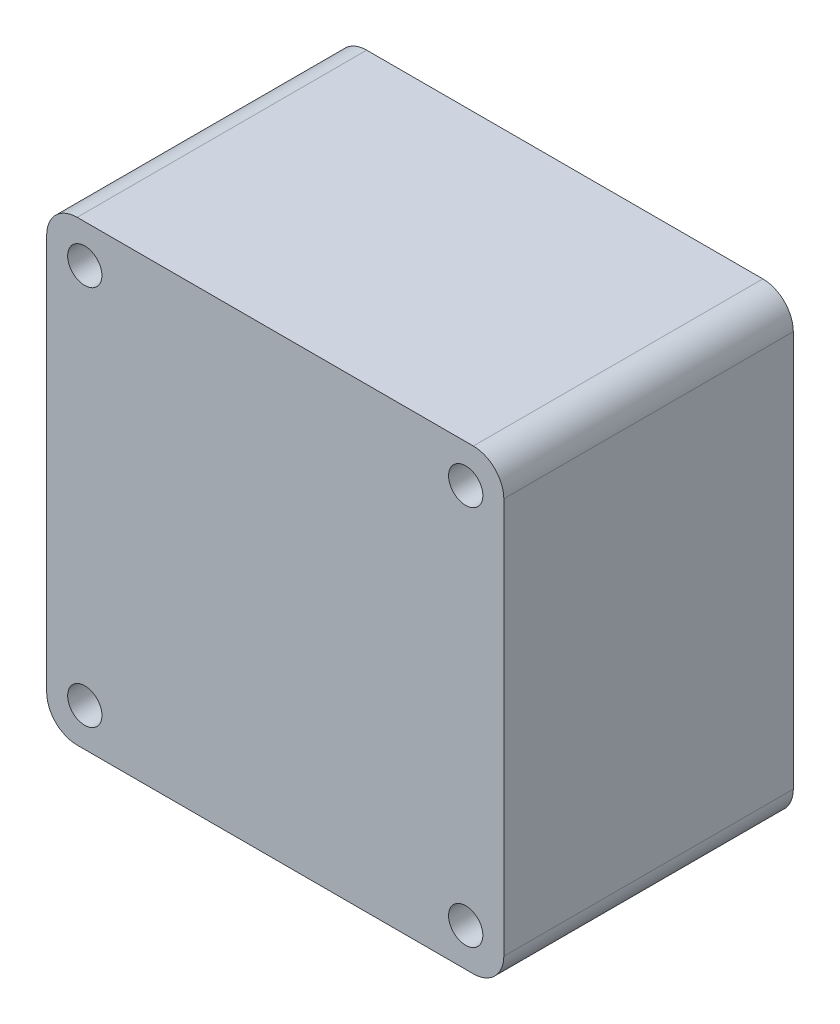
from build123d import *

# Parameters (mm, degrees)
BOSS_EXTRUDE1_DEPTH = 38


with BuildPart() as part:
    # Sketch1 → Boss-Extrude1 (new body)
    # profile 1 of 3: a face of its own
    with BuildSketch(Plane.XY):
        with BuildLine():
            Line((-661.346234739, 899.953843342), (-664.046234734, 899.953843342))
            Line((-664.046234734, 899.953843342), (-676.046234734, 899.953843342))
            ThreePointArc((-676.046234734, 899.953843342), (-678.874661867, 898.782270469), (-680.046234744, 895.953843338))
            Line((-680.046234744, 895.953843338), (-680.046234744, 843.953843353))
            ThreePointArc((-680.046234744, 843.953843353), (-678.874661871, 841.12541622), (-676.04623474, 839.953843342))
            Line((-676.04623474, 839.953843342), (-624.04623475, 839.953843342))
            ThreePointArc((-624.04623475, 839.953843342), (-621.21780762, 841.125416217), (-620.046234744, 843.953843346))
            Line((-620.046234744, 843.953843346), (-620.046234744, 895.953843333))
            ThreePointArc((-620.046234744, 895.953843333), (-621.217807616, 898.782270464), (-624.046234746, 899.953843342))
            Line((-624.046234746, 899.953843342), (-661.346234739, 899.953843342))
        make_face()
        with BuildLine():
            ThreePointArc((-675.046234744, 842.703843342), (-677.296234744, 844.953843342), (-675.046234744, 847.203843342))
            ThreePointArc((-675.046234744, 847.203843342), (-672.796234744, 844.953843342), (-675.046234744, 842.703843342))
        make_face(mode=Mode.SUBTRACT)
        with BuildLine():
            ThreePointArc((-625.046234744, 842.703843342), (-627.296234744, 844.953843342), (-625.046234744, 847.203843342))
            ThreePointArc((-625.046234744, 847.203843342), (-622.796234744, 844.953843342), (-625.046234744, 842.703843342))
        make_face(mode=Mode.SUBTRACT)
        with BuildLine():
            Line((-664.9552298, 894.125766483), (-664.716895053, 894.271156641))
            ThreePointArc((-664.716895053, 894.271156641), (-664.088337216, 894.408623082), (-663.50613927, 894.134711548))
            add(Edge.make_bspline(
                [(-658.121653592, 887.891570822), (-660.543434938, 891.277439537), (-663.50613927, 894.134711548)],
                knots=[0, 0, 0, 1, 1, 1], degree=2))
            add(Edge.make_bspline(
                [(-658.271486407, 884.487893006), (-657.203631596, 886.631955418), (-658.121653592, 887.891570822)],
                knots=[0, 0, 0, 1, 1, 1], degree=2))
            add(Edge.make_bspline(
                [(-664.364149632, 878.549619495), (-663.618421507, 879.790277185), (-662.731117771, 880.911489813), (-661.445018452, 882.163699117), (-661.178939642, 882.406814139), (-660.090776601, 883.338684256), (-659.212305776, 883.954721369), (-658.271486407, 884.487893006)],
                knots=[0, 0, 0, 0, 0.5, 0.5, 0.625, 0.625, 1, 1, 1, 1], degree=3))
            add(Edge.make_bspline(
                [(-668.05602351, 874.891401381), (-667.441263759, 875.036432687), (-666.886130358, 875.491409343), (-666.473815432, 875.829334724), (-665.978662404, 876.452181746), (-665.791309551, 876.687850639), (-665.587315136, 876.962328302), (-665.38241042, 877.238030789), (-665.180175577, 877.507700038), (-664.971843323, 877.785499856), (-664.771962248, 878.04063606), (-664.545101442, 878.330210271), (-664.477881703, 878.410328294), (-664.41984558, 878.479500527), (-664.364149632, 878.549619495)],
                knots=[0, 0, 0, 0.25, 0.25, 0.5, 0.5, 0.625, 0.625, 0.75, 0.75, 0.875, 0.875, 0.9375, 0.9375, 1, 1, 1], degree=2))
            add(Edge.make_bspline(
                [(-676.890334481, 871.917851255), (-672.608538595, 873.811948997), (-668.05602351, 874.891401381)],
                knots=[0, 0, 0, 1, 1, 1], degree=2))
            add(Edge.make_bspline(
                [(-678.193138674, 872.421419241), (-677.996815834, 872.036587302), (-677.641673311, 871.898340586), (-677.26558139, 871.751938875), (-676.890334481, 871.917851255)],
                knots=[0, 0, 0, 0.5, 0.5, 1, 1, 1], degree=2))
            Line((-678.193138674, 872.421419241), (-678.408149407, 872.320361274))
            add(Edge.make_bspline(
                [(-679.328332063, 872.325629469), (-678.680397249, 872.184605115), (-678.408149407, 872.320361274)],
                knots=[0, 0, 0, 1, 1, 1], degree=2))
            Line((-679.328332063, 872.325629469), (-679.328383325, 880.806097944))
            add(Edge.make_bspline(
                [(-677.901196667, 886.045224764), (-678.595453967, 884.843277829), (-678.958890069, 883.519020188), (-679.323376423, 882.190935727), (-679.328383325, 880.806097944)],
                knots=[0, 0, 0, 0.5, 0.5, 1, 1, 1], degree=2))
            add(Edge.make_bspline(
                [(-668.412813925, 896.364089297), (-670.331950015, 895.029454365), (-672.126662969, 893.467218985), (-675.327709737, 889.985590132), (-676.733129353, 888.0672103), (-677.901196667, 886.045224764)],
                knots=[0, 0, 0, 0, 0.5, 0.5, 1, 1, 1, 1], degree=3))
            add(Edge.make_bspline(
                [(-667.383787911, 896.199545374), (-667.568291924, 896.346764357), (-667.861267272, 896.377105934), (-668.104881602, 896.402335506), (-668.412813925, 896.364089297)],
                knots=[0, 0, 0, 0.5, 0.5, 1, 1, 1], degree=2))
            add(Edge.make_bspline(
                [(-664.9552298, 894.125766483), (-666.129879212, 895.205715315), (-667.383787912, 896.199545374)],
                knots=[0, 0, 0, 1, 1, 1], degree=2))
        make_face(mode=Mode.SUBTRACT)
        with BuildLine():
            ThreePointArc((-675.046234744, 892.703843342), (-677.296234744, 894.953843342), (-675.046234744, 897.203843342))
            ThreePointArc((-675.046234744, 897.203843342), (-672.796234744, 894.953843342), (-675.046234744, 892.703843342))
        make_face(mode=Mode.SUBTRACT)
        with BuildLine():
            Line((-656.439427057, 899.23599214), (-639.193980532, 899.235991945))
            add(Edge.make_bspline(
                [(-633.954855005, 897.808804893), (-635.156798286, 898.503062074), (-636.481058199, 898.866498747), (-637.809142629, 899.23098504), (-639.193980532, 899.235991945)],
                knots=[0, 0, 0, 0.5, 0.5, 1, 1, 1], degree=2))
            ThreePointArc((-633.954855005, 897.808804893), (-628.949939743, 894.239182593), (-624.715447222, 889.782675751))
            add(Edge.make_bspline(
                [(-634.200462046, 875.226554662), (-631.214906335, 878.430279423), (-628.827793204, 882.093986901), (-626.432517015, 885.770222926), (-624.715447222, 889.782675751)],
                knots=[0, 0, 0, 0.5, 0.5, 1, 1, 1], degree=2))
            add(Edge.make_bspline(
                [(-644.41311364, 885.675125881), (-643.217677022, 885.245645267), (-642.089680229, 884.690633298), (-640.763984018, 883.839954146), (-640.501423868, 883.660935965), (-639.480405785, 882.921465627), (-638.766213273, 882.305119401), (-637.993154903, 881.514014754), (-637.886347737, 881.40160896), (-637.038218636, 880.483995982), (-636.381231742, 879.616037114), (-635.768523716, 878.61638742), (-635.72655949, 878.546838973), (-635.076279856, 877.451244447), (-634.58112817, 876.367307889), (-634.200462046, 875.226554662)],
                knots=[0, 0, 0, 0, 0.25, 0.25, 0.3125, 0.3125, 0.5, 0.5, 0.53125, 0.53125, 0.75, 0.75, 0.765625, 0.765625, 1, 1, 1, 1], degree=3))
            add(Edge.make_bspline(
                [(-650.257591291, 888.825319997), (-649.841126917, 888.131920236), (-649.065604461, 887.650989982), (-648.470321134, 887.281832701), (-647.535992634, 886.944307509), (-645.573834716, 886.235480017), (-644.41311364, 885.675125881)],
                knots=[0, 0, 0, 0.25, 0.25, 0.5, 0.5, 1, 1, 1], degree=2))
            add(Edge.make_bspline(
                [(-655.722787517, 896.262520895), (-652.655373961, 892.789052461), (-650.257591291, 888.825319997)],
                knots=[0, 0, 0, 1, 1, 1], degree=2))
            add(Edge.make_bspline(
                [(-655.62357404, 897.647303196), (-655.77929345, 897.509217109), (-655.867852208, 897.32509057), (-655.949186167, 897.155985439), (-655.962849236, 896.974792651), (-655.97770994, 896.777717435), (-655.91516112, 896.593887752), (-655.852378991, 896.409372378), (-655.722787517, 896.262520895)],
                knots=[0, 0, 0, 0.25, 0.25, 0.5, 0.5, 0.75, 0.75, 1, 1, 1], degree=2))
            ThreePointArc((-655.62357404, 897.647303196), (-655.799620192, 897.838261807), (-655.976607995, 898.028347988))
            add(Edge.make_bspline(
                [(-656.439427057, 899.23599214), (-656.341033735, 898.822598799), (-656.273134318, 898.604864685), (-656.15154569, 898.214964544), (-655.976607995, 898.028347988)],
                knots=[0, 0, 0, 0.5, 0.5, 1, 1, 1], degree=2))
        make_face(mode=Mode.SUBTRACT)
        with BuildLine():
            ThreePointArc((-625.046234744, 892.703843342), (-627.296234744, 894.953843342), (-625.046234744, 897.203843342))
            ThreePointArc((-625.046234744, 897.203843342), (-622.796234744, 894.953843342), (-625.046234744, 892.703843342))
        make_face(mode=Mode.SUBTRACT)
    # profile 2 of 3: a face of its own
    with BuildSketch(Plane.XY):
        with BuildLine():
            ThreePointArc((-663.50613927, 894.134711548), (-664.088337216, 894.408623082), (-664.716895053, 894.271156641))
            Line((-664.716895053, 894.271156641), (-664.9552298, 894.125766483))
            add(Edge.make_bspline(
                [(-664.9552298, 894.125766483), (-666.129879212, 895.205715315), (-667.383787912, 896.199545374)],
                knots=[0, 0, 0, 1, 1, 1], degree=2))
            add(Edge.make_bspline(
                [(-667.383787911, 896.199545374), (-667.568291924, 896.346764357), (-667.861267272, 896.377105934), (-668.104881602, 896.402335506), (-668.412813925, 896.364089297)],
                knots=[0, 0, 0, 0.5, 0.5, 1, 1, 1], degree=2))
            add(Edge.make_bspline(
                [(-668.412813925, 896.364089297), (-670.331950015, 895.029454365), (-672.126662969, 893.467218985), (-675.327709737, 889.985590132), (-676.733129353, 888.0672103), (-677.901196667, 886.045224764)],
                knots=[0, 0, 0, 0, 0.5, 0.5, 1, 1, 1, 1], degree=3))
            add(Edge.make_bspline(
                [(-677.901196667, 886.045224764), (-678.595453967, 884.843277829), (-678.958890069, 883.519020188), (-679.323376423, 882.190935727), (-679.328383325, 880.806097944)],
                knots=[0, 0, 0, 0.5, 0.5, 1, 1, 1], degree=2))
            Line((-679.328383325, 880.806097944), (-679.328332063, 872.325629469))
            add(Edge.make_bspline(
                [(-679.328332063, 872.325629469), (-678.680397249, 872.184605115), (-678.408149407, 872.320361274)],
                knots=[0, 0, 0, 1, 1, 1], degree=2))
            Line((-678.408149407, 872.320361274), (-678.193138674, 872.421419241))
            add(Edge.make_bspline(
                [(-678.193138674, 872.421419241), (-677.996815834, 872.036587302), (-677.641673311, 871.898340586), (-677.26558139, 871.751938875), (-676.890334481, 871.917851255)],
                knots=[0, 0, 0, 0.5, 0.5, 1, 1, 1], degree=2))
            add(Edge.make_bspline(
                [(-676.890334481, 871.917851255), (-672.608538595, 873.811948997), (-668.05602351, 874.891401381)],
                knots=[0, 0, 0, 1, 1, 1], degree=2))
            add(Edge.make_bspline(
                [(-668.05602351, 874.891401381), (-667.441263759, 875.036432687), (-666.886130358, 875.491409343), (-666.473815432, 875.829334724), (-665.978662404, 876.452181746), (-665.791309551, 876.687850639), (-665.587315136, 876.962328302), (-665.38241042, 877.238030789), (-665.180175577, 877.507700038), (-664.971843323, 877.785499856), (-664.771962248, 878.04063606), (-664.545101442, 878.330210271), (-664.477881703, 878.410328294), (-664.41984558, 878.479500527), (-664.364149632, 878.549619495)],
                knots=[0, 0, 0, 0.25, 0.25, 0.5, 0.5, 0.625, 0.625, 0.75, 0.75, 0.875, 0.875, 0.9375, 0.9375, 1, 1, 1], degree=2))
            add(Edge.make_bspline(
                [(-664.364149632, 878.549619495), (-663.618421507, 879.790277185), (-662.731117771, 880.911489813), (-661.445018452, 882.163699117), (-661.178939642, 882.406814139), (-660.090776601, 883.338684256), (-659.212305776, 883.954721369), (-658.271486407, 884.487893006)],
                knots=[0, 0, 0, 0, 0.5, 0.5, 0.625, 0.625, 1, 1, 1, 1], degree=3))
            add(Edge.make_bspline(
                [(-658.271486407, 884.487893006), (-657.203631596, 886.631955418), (-658.121653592, 887.891570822)],
                knots=[0, 0, 0, 1, 1, 1], degree=2))
            add(Edge.make_bspline(
                [(-658.121653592, 887.891570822), (-660.543434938, 891.277439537), (-663.50613927, 894.134711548)],
                knots=[0, 0, 0, 1, 1, 1], degree=2))
        make_face()
    # profile 3 of 3: a face of its own
    with BuildSketch(Plane.XY):
        with BuildLine():
            add(Edge.make_bspline(
                [(-633.954855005, 897.808804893), (-635.156798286, 898.503062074), (-636.481058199, 898.866498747), (-637.809142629, 899.23098504), (-639.193980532, 899.235991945)],
                knots=[0, 0, 0, 0.5, 0.5, 1, 1, 1], degree=2))
            Line((-639.193980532, 899.235991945), (-656.439427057, 899.23599214))
            add(Edge.make_bspline(
                [(-656.439427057, 899.23599214), (-656.341033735, 898.822598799), (-656.273134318, 898.604864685), (-656.15154569, 898.214964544), (-655.976607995, 898.028347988)],
                knots=[0, 0, 0, 0.5, 0.5, 1, 1, 1], degree=2))
            ThreePointArc((-655.976607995, 898.028347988), (-655.799620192, 897.838261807), (-655.62357404, 897.647303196))
            add(Edge.make_bspline(
                [(-655.62357404, 897.647303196), (-655.77929345, 897.509217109), (-655.867852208, 897.32509057), (-655.949186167, 897.155985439), (-655.962849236, 896.974792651), (-655.97770994, 896.777717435), (-655.91516112, 896.593887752), (-655.852378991, 896.409372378), (-655.722787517, 896.262520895)],
                knots=[0, 0, 0, 0.25, 0.25, 0.5, 0.5, 0.75, 0.75, 1, 1, 1], degree=2))
            add(Edge.make_bspline(
                [(-655.722787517, 896.262520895), (-652.655373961, 892.789052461), (-650.257591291, 888.825319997)],
                knots=[0, 0, 0, 1, 1, 1], degree=2))
            add(Edge.make_bspline(
                [(-650.257591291, 888.825319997), (-649.841126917, 888.131920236), (-649.065604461, 887.650989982), (-648.470321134, 887.281832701), (-647.535992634, 886.944307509), (-645.573834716, 886.235480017), (-644.41311364, 885.675125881)],
                knots=[0, 0, 0, 0.25, 0.25, 0.5, 0.5, 1, 1, 1], degree=2))
            add(Edge.make_bspline(
                [(-644.41311364, 885.675125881), (-643.217677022, 885.245645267), (-642.089680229, 884.690633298), (-640.763984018, 883.839954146), (-640.501423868, 883.660935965), (-639.480405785, 882.921465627), (-638.766213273, 882.305119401), (-637.993154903, 881.514014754), (-637.886347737, 881.40160896), (-637.038218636, 880.483995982), (-636.381231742, 879.616037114), (-635.768523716, 878.61638742), (-635.72655949, 878.546838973), (-635.076279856, 877.451244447), (-634.58112817, 876.367307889), (-634.200462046, 875.226554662)],
                knots=[0, 0, 0, 0, 0.25, 0.25, 0.3125, 0.3125, 0.5, 0.5, 0.53125, 0.53125, 0.75, 0.75, 0.765625, 0.765625, 1, 1, 1, 1], degree=3))
            add(Edge.make_bspline(
                [(-634.200462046, 875.226554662), (-631.214906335, 878.430279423), (-628.827793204, 882.093986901), (-626.432517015, 885.770222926), (-624.715447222, 889.782675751)],
                knots=[0, 0, 0, 0.5, 0.5, 1, 1, 1], degree=2))
            ThreePointArc((-624.715447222, 889.782675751), (-628.949939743, 894.239182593), (-633.954855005, 897.808804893))
        make_face()
    extrude(amount=-BOSS_EXTRUDE1_DEPTH)


solid = part.part
